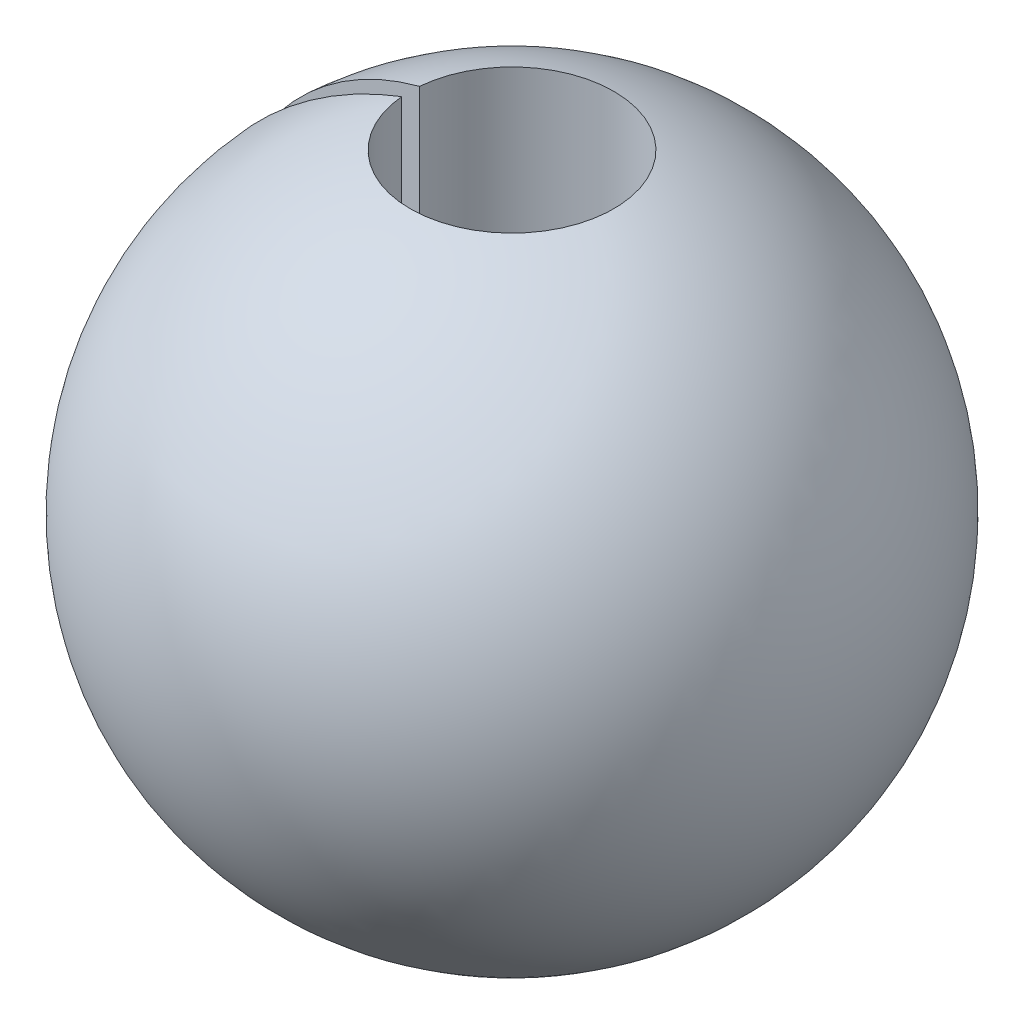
from build123d import *

# Parameters (mm, degrees)
CUT_EXTRUDE_1_DEPTH = 1007


with BuildPart() as part:
    # Sketch 2 → Revolve 1 (revolve)
    with BuildSketch(Plane(origin=(0, 0, 0), x_dir=(0, 0, -1), z_dir=(1, 0, 0))):
        with BuildLine():
            Line((-202, 622.022507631), (-202, -622.022507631))
            ThreePointArc((-202, -622.022507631), (-654, 0), (-202, 622.022507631))
        make_face()
    revolve(axis=Axis((0, -6735.657510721, 0), (0, 1, 0)))

    # Sketch 3 → Cut-Extrude 1 (cut, symmetric)
    with BuildSketch(Plane(origin=(0, 0, 0), x_dir=(1, 0, 0), z_dir=(0, 1, 0))):
        Polygon((0, 0), (-823.992991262, 72.09004556), (-823.992991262, -72.09004556), align=None)
    extrude(amount=CUT_EXTRUDE_1_DEPTH, both=True, mode=Mode.SUBTRACT)


solid = part.part
